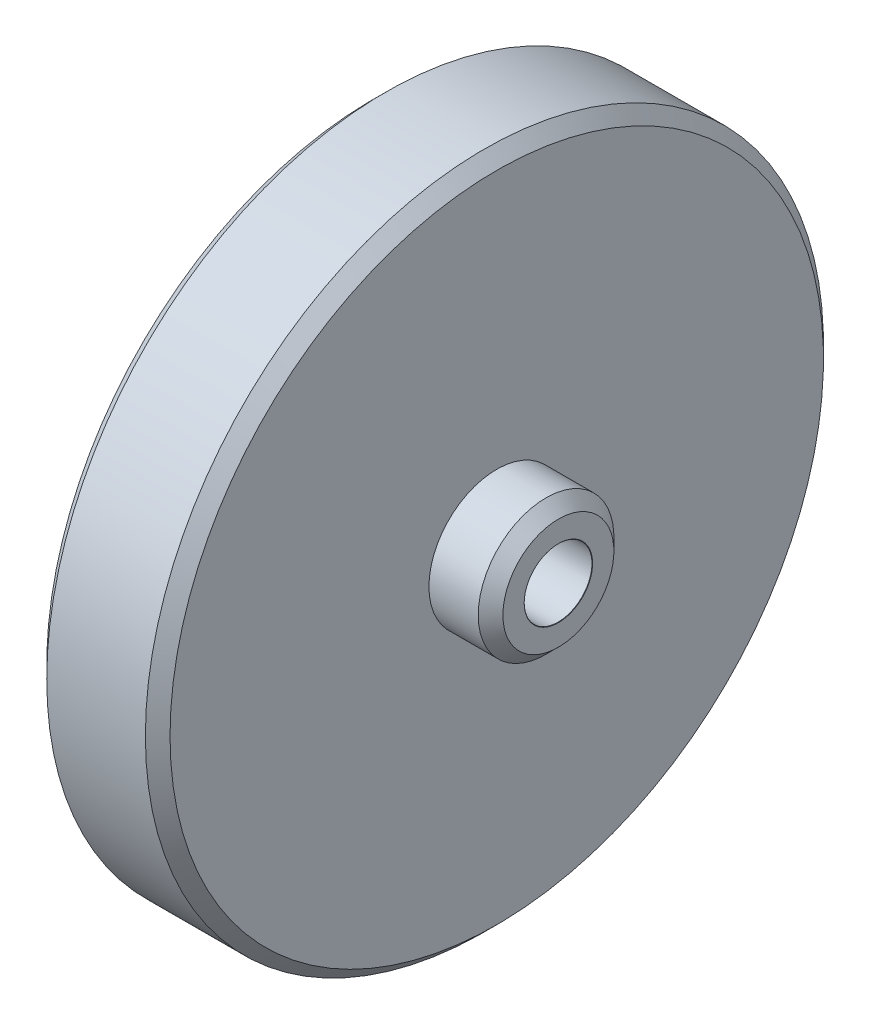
ISO-10303-21;
HEADER;
FILE_DESCRIPTION(('STEP AP214'),'2;1');
FILE_NAME('part.step','',(''),(''),'','','');
FILE_SCHEMA(('AUTOMOTIVE_DESIGN { 1 0 10303 214 1 1 1 1 }'));
ENDSEC;
DATA;
#1=APPLICATION_CONTEXT('core data for automotive mechanical design processes');
#2=APPLICATION_PROTOCOL_DEFINITION('international standard','automotive_design',2000,#1);
#3=PRODUCT_CONTEXT('',#1,'mechanical');
#4=PRODUCT('Part','Part','',(#3));
#5=PRODUCT_RELATED_PRODUCT_CATEGORY('part','',(#4));
#6=PRODUCT_DEFINITION_FORMATION('','',#4);
#7=PRODUCT_DEFINITION_CONTEXT('part definition',#1,'design');
#8=PRODUCT_DEFINITION('design','',#6,#7);
#9=PRODUCT_DEFINITION_SHAPE('','',#8);
#10=(LENGTH_UNIT() NAMED_UNIT(*) SI_UNIT(.MILLI.,.METRE.));
#11=(NAMED_UNIT(*) PLANE_ANGLE_UNIT() SI_UNIT($,.RADIAN.));
#12=(NAMED_UNIT(*) SI_UNIT($,.STERADIAN.) SOLID_ANGLE_UNIT());
#13=UNCERTAINTY_MEASURE_WITH_UNIT(LENGTH_MEASURE(1.E-05),#10,'distance_accuracy_value','');
#14=(GEOMETRIC_REPRESENTATION_CONTEXT(3) GLOBAL_UNCERTAINTY_ASSIGNED_CONTEXT((#13)) GLOBAL_UNIT_ASSIGNED_CONTEXT((#10,
#11,#12)) REPRESENTATION_CONTEXT('',''));
#15=CARTESIAN_POINT('',(0.,0.,0.));
#16=DIRECTION('',(0.,0.,1.));
#17=DIRECTION('',(1.,0.,0.));
#18=AXIS2_PLACEMENT_3D('',#15,#16,#17);
#19=CARTESIAN_POINT('',(5.,0.,0.));
#20=DIRECTION('',(-1.,0.,0.));
#21=DIRECTION('',(0.,0.,1.));
#22=AXIS2_PLACEMENT_3D('',#19,#20,#21);
#23=PLANE('',#22);
#24=CARTESIAN_POINT('',(5.,0.,0.));
#25=DIRECTION('',(-1.,0.,0.));
#26=DIRECTION('',(0.,0.,1.));
#27=AXIS2_PLACEMENT_3D('',#24,#25,#26);
#28=CIRCLE('',#27,2.775);
#29=CARTESIAN_POINT('',(5.,0.,2.775));
#30=VERTEX_POINT('',#29);
#31=EDGE_CURVE('E75',#30,#30,#28,.T.);
#32=ORIENTED_EDGE('',*,*,#31,.T.);
#33=EDGE_LOOP('',(#32));
#34=FACE_BOUND('',#33,.T.);
#35=CARTESIAN_POINT('',(5.,0.,0.));
#36=DIRECTION('',(-1.,0.,0.));
#37=DIRECTION('',(0.,0.,1.));
#38=AXIS2_PLACEMENT_3D('',#35,#36,#37);
#39=CIRCLE('',#38,4.5);
#40=CARTESIAN_POINT('',(5.,0.,4.5));
#41=VERTEX_POINT('',#40);
#42=EDGE_CURVE('E51',#41,#41,#39,.T.);
#43=ORIENTED_EDGE('',*,*,#42,.F.);
#44=EDGE_LOOP('',(#43));
#45=FACE_BOUND('',#44,.T.);
#46=ADVANCED_FACE('F31',(#34,#45),#23,.F.);
#47=CARTESIAN_POINT('',(5.,0.,0.));
#48=DIRECTION('',(-1.,0.,0.));
#49=DIRECTION('',(0.,0.,1.));
#50=AXIS2_PLACEMENT_3D('',#47,#48,#49);
#51=CONICAL_SURFACE('',#50,4.5,0.785398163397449);
#52=CARTESIAN_POINT('',(4.,0.,0.));
#53=DIRECTION('',(-1.,0.,0.));
#54=DIRECTION('',(0.,0.,1.));
#55=AXIS2_PLACEMENT_3D('',#52,#53,#54);
#56=CIRCLE('',#55,5.5);
#57=CARTESIAN_POINT('',(4.,0.,5.5));
#58=VERTEX_POINT('',#57);
#59=EDGE_CURVE('E54',#58,#58,#56,.T.);
#60=ORIENTED_EDGE('',*,*,#59,.F.);
#61=EDGE_LOOP('',(#60));
#62=FACE_BOUND('',#61,.T.);
#63=ORIENTED_EDGE('',*,*,#42,.T.);
#64=EDGE_LOOP('',(#63));
#65=FACE_BOUND('',#64,.T.);
#66=ADVANCED_FACE('F127',(#62,#65),#51,.T.);
#67=CARTESIAN_POINT('',(-10.,0.,0.));
#68=DIRECTION('',(-1.,0.,0.));
#69=DIRECTION('',(0.,0.,1.));
#70=AXIS2_PLACEMENT_3D('',#67,#68,#69);
#71=CYLINDRICAL_SURFACE('',#70,5.5);
#72=CARTESIAN_POINT('',(0.,0.,0.));
#73=DIRECTION('',(-1.,0.,0.));
#74=DIRECTION('',(0.,0.,1.));
#75=AXIS2_PLACEMENT_3D('',#72,#73,#74);
#76=CIRCLE('',#75,5.5);
#77=CARTESIAN_POINT('',(0.,0.,5.5));
#78=VERTEX_POINT('',#77);
#79=EDGE_CURVE('E57',#78,#78,#76,.T.);
#80=ORIENTED_EDGE('',*,*,#79,.F.);
#81=EDGE_LOOP('',(#80));
#82=FACE_BOUND('',#81,.T.);
#83=ORIENTED_EDGE('',*,*,#59,.T.);
#84=EDGE_LOOP('',(#83));
#85=FACE_BOUND('',#84,.T.);
#86=ADVANCED_FACE('F131',(#82,#85),#71,.T.);
#87=CARTESIAN_POINT('',(0.,5.5,0.));
#88=DIRECTION('',(-1.,0.,0.));
#89=DIRECTION('',(0.,0.,1.));
#90=AXIS2_PLACEMENT_3D('',#87,#88,#89);
#91=PLANE('',#90);
#92=CARTESIAN_POINT('',(0.,0.,0.));
#93=DIRECTION('',(-1.,0.,0.));
#94=DIRECTION('',(0.,0.,1.));
#95=AXIS2_PLACEMENT_3D('',#92,#93,#94);
#96=CIRCLE('',#95,26.5);
#97=CARTESIAN_POINT('',(0.,0.,26.5));
#98=VERTEX_POINT('',#97);
#99=EDGE_CURVE('E10',#98,#98,#96,.F.);
#100=ORIENTED_EDGE('',*,*,#99,.T.);
#101=EDGE_LOOP('',(#100));
#102=FACE_BOUND('',#101,.T.);
#103=ORIENTED_EDGE('',*,*,#79,.T.);
#104=EDGE_LOOP('',(#103));
#105=FACE_BOUND('',#104,.T.);
#106=ADVANCED_FACE('F137',(#102,#105),#91,.F.);
#107=CARTESIAN_POINT('',(-10.,0.,0.));
#108=DIRECTION('',(-1.,0.,0.));
#109=DIRECTION('',(0.,0.,1.));
#110=AXIS2_PLACEMENT_3D('',#107,#108,#109);
#111=CYLINDRICAL_SURFACE('',#110,27.5);
#112=CARTESIAN_POINT('',(-9.,0.,0.));
#113=DIRECTION('',(1.,0.,0.));
#114=DIRECTION('',(0.,0.,-1.));
#115=AXIS2_PLACEMENT_3D('',#112,#113,#114);
#116=CIRCLE('',#115,27.5);
#117=CARTESIAN_POINT('',(-9.,0.,-27.5));
#118=VERTEX_POINT('',#117);
#119=EDGE_CURVE('E38',#118,#118,#116,.T.);
#120=ORIENTED_EDGE('',*,*,#119,.T.);
#121=EDGE_LOOP('',(#120));
#122=FACE_BOUND('',#121,.T.);
#123=CARTESIAN_POINT('',(-1.00000000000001,0.,0.));
#124=DIRECTION('',(-1.,0.,0.));
#125=DIRECTION('',(0.,0.,1.));
#126=AXIS2_PLACEMENT_3D('',#123,#124,#125);
#127=CIRCLE('',#126,27.5);
#128=CARTESIAN_POINT('',(-1.00000000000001,0.,27.5));
#129=VERTEX_POINT('',#128);
#130=EDGE_CURVE('E42',#129,#129,#127,.T.);
#131=ORIENTED_EDGE('',*,*,#130,.T.);
#132=EDGE_LOOP('',(#131));
#133=FACE_BOUND('',#132,.T.);
#134=ADVANCED_FACE('F115',(#122,#133),#111,.T.);
#135=CARTESIAN_POINT('',(-10.,27.5,0.));
#136=DIRECTION('',(1.,0.,0.));
#137=DIRECTION('',(0.,0.,-1.));
#138=AXIS2_PLACEMENT_3D('',#135,#136,#137);
#139=PLANE('',#138);
#140=CARTESIAN_POINT('',(-10.,0.,0.));
#141=DIRECTION('',(-1.,0.,0.));
#142=DIRECTION('',(0.,0.,1.));
#143=AXIS2_PLACEMENT_3D('',#140,#141,#142);
#144=CIRCLE('',#143,5.025);
#145=CARTESIAN_POINT('',(-10.,0.,5.025));
#146=VERTEX_POINT('',#145);
#147=EDGE_CURVE('E72',#146,#146,#144,.T.);
#148=ORIENTED_EDGE('',*,*,#147,.F.);
#149=EDGE_LOOP('',(#148));
#150=FACE_BOUND('',#149,.T.);
#151=CARTESIAN_POINT('',(-10.,0.,0.));
#152=DIRECTION('',(1.,0.,0.));
#153=DIRECTION('',(0.,0.,-1.));
#154=AXIS2_PLACEMENT_3D('',#151,#152,#153);
#155=CIRCLE('',#154,26.5);
#156=CARTESIAN_POINT('',(-10.,0.,-26.5));
#157=VERTEX_POINT('',#156);
#158=EDGE_CURVE('E46',#157,#157,#155,.F.);
#159=ORIENTED_EDGE('',*,*,#158,.T.);
#160=EDGE_LOOP('',(#159));
#161=FACE_BOUND('',#160,.T.);
#162=ADVANCED_FACE('F111',(#150,#161),#139,.F.);
#163=CARTESIAN_POINT('',(-10.,0.,0.));
#164=DIRECTION('',(1.,0.,0.));
#165=DIRECTION('',(0.,0.,-1.));
#166=AXIS2_PLACEMENT_3D('',#163,#164,#165);
#167=CONICAL_SURFACE('',#166,26.5,0.78539816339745);
#168=ORIENTED_EDGE('',*,*,#119,.F.);
#169=EDGE_LOOP('',(#168));
#170=FACE_BOUND('',#169,.T.);
#171=ORIENTED_EDGE('',*,*,#158,.F.);
#172=EDGE_LOOP('',(#171));
#173=FACE_BOUND('',#172,.T.);
#174=ADVANCED_FACE('F114',(#170,#173),#167,.T.);
#175=CARTESIAN_POINT('',(-1.00000000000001,0.,0.));
#176=DIRECTION('',(-1.,0.,0.));
#177=DIRECTION('',(0.,0.,1.));
#178=AXIS2_PLACEMENT_3D('',#175,#176,#177);
#179=CONICAL_SURFACE('',#178,27.5,0.785398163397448);
#180=ORIENTED_EDGE('',*,*,#99,.F.);
#181=EDGE_LOOP('',(#180));
#182=FACE_BOUND('',#181,.T.);
#183=ORIENTED_EDGE('',*,*,#130,.F.);
#184=EDGE_LOOP('',(#183));
#185=FACE_BOUND('',#184,.T.);
#186=ADVANCED_FACE('F33',(#182,#185),#179,.T.);
#187=CARTESIAN_POINT('',(4.975,0.,0.));
#188=DIRECTION('',(1.,0.,0.));
#189=DIRECTION('',(0.,0.,-1.));
#190=AXIS2_PLACEMENT_3D('',#187,#188,#189);
#191=CONICAL_SURFACE('',#190,2.75,0.785398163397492);
#192=ORIENTED_EDGE('',*,*,#31,.F.);
#193=EDGE_LOOP('',(#192));
#194=FACE_BOUND('',#193,.T.);
#195=CARTESIAN_POINT('',(4.975,0.,0.));
#196=DIRECTION('',(-1.,0.,0.));
#197=DIRECTION('',(0.,0.,1.));
#198=AXIS2_PLACEMENT_3D('',#195,#196,#197);
#199=CIRCLE('',#198,2.75);
#200=CARTESIAN_POINT('',(4.975,0.,2.75));
#201=VERTEX_POINT('',#200);
#202=EDGE_CURVE('E60',#201,#201,#199,.T.);
#203=ORIENTED_EDGE('',*,*,#202,.T.);
#204=EDGE_LOOP('',(#203));
#205=FACE_BOUND('',#204,.T.);
#206=ADVANCED_FACE('F81',(#194,#205),#191,.F.);
#207=CARTESIAN_POINT('',(-10.,0.,0.));
#208=DIRECTION('',(-1.,0.,0.));
#209=DIRECTION('',(0.,0.,1.));
#210=AXIS2_PLACEMENT_3D('',#207,#208,#209);
#211=CYLINDRICAL_SURFACE('',#210,2.75);
#212=ORIENTED_EDGE('',*,*,#202,.F.);
#213=EDGE_LOOP('',(#212));
#214=FACE_BOUND('',#213,.T.);
#215=CARTESIAN_POINT('',(-5.,0.,0.));
#216=DIRECTION('',(-1.,0.,0.));
#217=DIRECTION('',(0.,0.,1.));
#218=AXIS2_PLACEMENT_3D('',#215,#216,#217);
#219=CIRCLE('',#218,2.75);
#220=CARTESIAN_POINT('',(-5.,0.,2.75));
#221=VERTEX_POINT('',#220);
#222=EDGE_CURVE('E63',#221,#221,#219,.T.);
#223=ORIENTED_EDGE('',*,*,#222,.T.);
#224=EDGE_LOOP('',(#223));
#225=FACE_BOUND('',#224,.T.);
#226=ADVANCED_FACE('F84',(#214,#225),#211,.F.);
#227=CARTESIAN_POINT('',(-5.,5.,0.));
#228=DIRECTION('',(1.,0.,0.));
#229=DIRECTION('',(0.,0.,-1.));
#230=AXIS2_PLACEMENT_3D('',#227,#228,#229);
#231=PLANE('',#230);
#232=ORIENTED_EDGE('',*,*,#222,.F.);
#233=EDGE_LOOP('',(#232));
#234=FACE_BOUND('',#233,.T.);
#235=CARTESIAN_POINT('',(-5.,0.,0.));
#236=DIRECTION('',(-1.,0.,0.));
#237=DIRECTION('',(0.,0.,1.));
#238=AXIS2_PLACEMENT_3D('',#235,#236,#237);
#239=CIRCLE('',#238,5.);
#240=CARTESIAN_POINT('',(-5.,0.,5.));
#241=VERTEX_POINT('',#240);
#242=EDGE_CURVE('E66',#241,#241,#239,.T.);
#243=ORIENTED_EDGE('',*,*,#242,.T.);
#244=EDGE_LOOP('',(#243));
#245=FACE_BOUND('',#244,.T.);
#246=ADVANCED_FACE('F90',(#234,#245),#231,.F.);
#247=CARTESIAN_POINT('',(-10.,0.,0.));
#248=DIRECTION('',(-1.,0.,0.));
#249=DIRECTION('',(0.,0.,1.));
#250=AXIS2_PLACEMENT_3D('',#247,#248,#249);
#251=CYLINDRICAL_SURFACE('',#250,5.);
#252=ORIENTED_EDGE('',*,*,#242,.F.);
#253=EDGE_LOOP('',(#252));
#254=FACE_BOUND('',#253,.T.);
#255=CARTESIAN_POINT('',(-9.975,0.,0.));
#256=DIRECTION('',(-1.,0.,0.));
#257=DIRECTION('',(0.,0.,1.));
#258=AXIS2_PLACEMENT_3D('',#255,#256,#257);
#259=CIRCLE('',#258,5.);
#260=CARTESIAN_POINT('',(-9.975,0.,5.));
#261=VERTEX_POINT('',#260);
#262=EDGE_CURVE('E69',#261,#261,#259,.T.);
#263=ORIENTED_EDGE('',*,*,#262,.T.);
#264=EDGE_LOOP('',(#263));
#265=FACE_BOUND('',#264,.T.);
#266=ADVANCED_FACE('F96',(#254,#265),#251,.F.);
#267=CARTESIAN_POINT('',(-10.,0.,0.));
#268=DIRECTION('',(-1.,0.,0.));
#269=DIRECTION('',(0.,0.,1.));
#270=AXIS2_PLACEMENT_3D('',#267,#268,#269);
#271=CONICAL_SURFACE('',#270,5.025,0.785398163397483);
#272=ORIENTED_EDGE('',*,*,#262,.F.);
#273=EDGE_LOOP('',(#272));
#274=FACE_BOUND('',#273,.T.);
#275=ORIENTED_EDGE('',*,*,#147,.T.);
#276=EDGE_LOOP('',(#275));
#277=FACE_BOUND('',#276,.T.);
#278=ADVANCED_FACE('F102',(#274,#277),#271,.F.);
#279=CLOSED_SHELL('',(#46,#66,#86,#106,#134,#162,#174,#186,#206,#226,#246,#266,#278));
#280=MANIFOLD_SOLID_BREP('B2',#279);
#281=ADVANCED_BREP_SHAPE_REPRESENTATION('',(#18,#280),#14);
#282=SHAPE_DEFINITION_REPRESENTATION(#9,#281);
ENDSEC;
END-ISO-10303-21;
